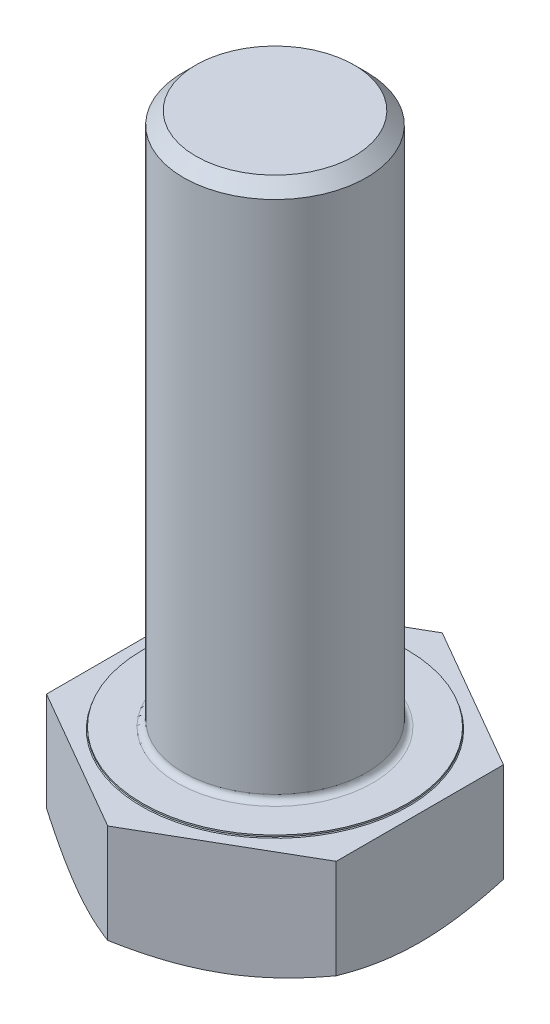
ISO-10303-21;
HEADER;
FILE_DESCRIPTION(('STEP AP214'),'2;1');
FILE_NAME('part.step','',(''),(''),'','','');
FILE_SCHEMA(('AUTOMOTIVE_DESIGN { 1 0 10303 214 1 1 1 1 }'));
ENDSEC;
DATA;
#1=APPLICATION_CONTEXT('core data for automotive mechanical design processes');
#2=APPLICATION_PROTOCOL_DEFINITION('international standard','automotive_design',2000,#1);
#3=PRODUCT_CONTEXT('',#1,'mechanical');
#4=PRODUCT('Part','Part','',(#3));
#5=PRODUCT_RELATED_PRODUCT_CATEGORY('part','',(#4));
#6=PRODUCT_DEFINITION_FORMATION('','',#4);
#7=PRODUCT_DEFINITION_CONTEXT('part definition',#1,'design');
#8=PRODUCT_DEFINITION('design','',#6,#7);
#9=PRODUCT_DEFINITION_SHAPE('','',#8);
#10=(LENGTH_UNIT() NAMED_UNIT(*) SI_UNIT(.MILLI.,.METRE.));
#11=(NAMED_UNIT(*) PLANE_ANGLE_UNIT() SI_UNIT($,.RADIAN.));
#12=(NAMED_UNIT(*) SI_UNIT($,.STERADIAN.) SOLID_ANGLE_UNIT());
#13=UNCERTAINTY_MEASURE_WITH_UNIT(LENGTH_MEASURE(1.E-05),#10,'distance_accuracy_value','');
#14=(GEOMETRIC_REPRESENTATION_CONTEXT(3) GLOBAL_UNCERTAINTY_ASSIGNED_CONTEXT((#13)) GLOBAL_UNIT_ASSIGNED_CONTEXT((#10,
#11,#12)) REPRESENTATION_CONTEXT('',''));
#15=CARTESIAN_POINT('',(0.,0.,0.));
#16=DIRECTION('',(0.,0.,1.));
#17=DIRECTION('',(1.,0.,0.));
#18=AXIS2_PLACEMENT_3D('',#15,#16,#17);
#19=CARTESIAN_POINT('',(0.,-7.5,0.));
#20=DIRECTION('',(0.,-1.,0.));
#21=DIRECTION('',(0.,0.,-1.));
#22=AXIS2_PLACEMENT_3D('',#19,#20,#21);
#23=PLANE('',#22);
#24=CARTESIAN_POINT('',(0.,-7.49999999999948,0.));
#25=DIRECTION('',(0.,1.,0.));
#26=DIRECTION('',(0.,0.,1.));
#27=AXIS2_PLACEMENT_3D('',#24,#25,#26);
#28=CIRCLE('',#27,9.4999999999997);
#29=CARTESIAN_POINT('',(-9.49999999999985,-7.49999999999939,0.));
#30=VERTEX_POINT('',#29);
#31=CARTESIAN_POINT('',(-4.74999999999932,-7.50000000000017,8.22724133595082));
#32=VERTEX_POINT('',#31);
#33=EDGE_CURVE('E174',#30,#32,#28,.T.);
#34=ORIENTED_EDGE('',*,*,#33,.F.);
#35=CARTESIAN_POINT('',(0.,-7.49999999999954,0.));
#36=DIRECTION('',(0.,1.,0.));
#37=DIRECTION('',(0.,0.,1.));
#38=AXIS2_PLACEMENT_3D('',#35,#36,#37);
#39=CIRCLE('',#38,9.49999999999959);
#40=CARTESIAN_POINT('',(-4.74999999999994,-7.49999999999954,-8.2272413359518));
#41=VERTEX_POINT('',#40);
#42=EDGE_CURVE('E59',#41,#30,#39,.T.);
#43=ORIENTED_EDGE('',*,*,#42,.F.);
#44=CARTESIAN_POINT('',(0.,-7.49999999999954,0.));
#45=DIRECTION('',(0.,1.,0.));
#46=DIRECTION('',(0.,0.,1.));
#47=AXIS2_PLACEMENT_3D('',#44,#45,#46);
#48=CIRCLE('',#47,9.49999999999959);
#49=CARTESIAN_POINT('',(4.74999999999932,-7.50000000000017,-8.22724133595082));
#50=VERTEX_POINT('',#49);
#51=EDGE_CURVE('E76',#50,#41,#48,.T.);
#52=ORIENTED_EDGE('',*,*,#51,.F.);
#53=CARTESIAN_POINT('',(0.,-7.49999999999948,0.));
#54=DIRECTION('',(0.,1.,0.));
#55=DIRECTION('',(0.,0.,1.));
#56=AXIS2_PLACEMENT_3D('',#53,#54,#55);
#57=CIRCLE('',#56,9.4999999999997);
#58=CARTESIAN_POINT('',(9.49999999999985,-7.49999999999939,0.));
#59=VERTEX_POINT('',#58);
#60=EDGE_CURVE('E74',#59,#50,#57,.T.);
#61=ORIENTED_EDGE('',*,*,#60,.F.);
#62=CARTESIAN_POINT('',(0.,-7.49999999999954,0.));
#63=DIRECTION('',(0.,1.,0.));
#64=DIRECTION('',(0.,0.,1.));
#65=AXIS2_PLACEMENT_3D('',#62,#63,#64);
#66=CIRCLE('',#65,9.49999999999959);
#67=CARTESIAN_POINT('',(4.74999999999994,-7.49999999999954,8.2272413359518));
#68=VERTEX_POINT('',#67);
#69=EDGE_CURVE('E175',#68,#59,#66,.T.);
#70=ORIENTED_EDGE('',*,*,#69,.F.);
#71=CARTESIAN_POINT('',(0.,-7.49999999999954,0.));
#72=DIRECTION('',(0.,1.,0.));
#73=DIRECTION('',(0.,0.,1.));
#74=AXIS2_PLACEMENT_3D('',#71,#72,#73);
#75=CIRCLE('',#74,9.49999999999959);
#76=EDGE_CURVE('E170',#32,#68,#75,.T.);
#77=ORIENTED_EDGE('',*,*,#76,.F.);
#78=EDGE_LOOP('',(#34,#43,#52,#61,#70,#77));
#79=FACE_BOUND('',#78,.T.);
#80=ADVANCED_FACE('F42',(#79),#23,.T.);
#81=CARTESIAN_POINT('',(0.,-6.64640318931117,0.));
#82=DIRECTION('',(0.,1.,0.));
#83=DIRECTION('',(0.,0.,1.));
#84=AXIS2_PLACEMENT_3D('',#81,#82,#83);
#85=CONICAL_SURFACE('',#84,10.9784730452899,1.0471975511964);
#86=CARTESIAN_POINT('',(9.49999999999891,-6.6514942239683,-5.48482755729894));
#87=CARTESIAN_POINT('',(9.11335202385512,-6.78040921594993,-5.70805887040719));
#88=CARTESIAN_POINT('',(8.72360763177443,-6.89851785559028,-5.93307790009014));
#89=CARTESIAN_POINT('',(7.94068328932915,-7.10680031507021,-6.38509947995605));
#90=CARTESIAN_POINT('',(7.54753064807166,-7.19711226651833,-6.61208626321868));
#91=CARTESIAN_POINT('',(6.95409127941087,-7.30800000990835,-6.95470864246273));
#92=CARTESIAN_POINT('',(6.75552851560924,-7.34087935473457,-7.06934890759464));
#93=CARTESIAN_POINT('',(6.35745238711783,-7.39779418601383,-7.29917826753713));
#94=CARTESIAN_POINT('',(6.15793904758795,-7.42182990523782,-7.41436734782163));
#95=CARTESIAN_POINT('',(5.75722379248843,-7.46063517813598,-7.64572040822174));
#96=CARTESIAN_POINT('',(5.55601842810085,-7.47535760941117,-7.76188637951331));
#97=CARTESIAN_POINT('',(5.15321199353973,-7.49506039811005,-7.9944467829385));
#98=CARTESIAN_POINT('',(4.95161085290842,-7.50003882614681,-8.11084125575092));
#99=CARTESIAN_POINT('',(4.74999999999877,-7.50000000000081,-8.22724133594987));
#100=B_SPLINE_CURVE_WITH_KNOTS('',3,(#86,#87,#88,#89,#90,#91,#92,#93,#94,#95,#96,#97,#98,#99),
.UNSPECIFIED.,.F.,.F.,(4,2,2,2,2,2,4),(0.,1.39466965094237,2.78229242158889,3.47701423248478,
4.17171775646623,4.86990873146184,5.5682379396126),.UNSPECIFIED.);
#101=CARTESIAN_POINT('',(9.5,-6.65149422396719,-5.484827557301));
#102=VERTEX_POINT('',#101);
#103=EDGE_CURVE('E159',#102,#50,#100,.T.);
#104=ORIENTED_EDGE('',*,*,#103,.F.);
#105=CARTESIAN_POINT('',(9.5,-7.4999999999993,0.));
#106=CARTESIAN_POINT('',(9.5,-7.5000388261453,-0.232800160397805));
#107=CARTESIAN_POINT('',(9.5,-7.49506039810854,-0.465589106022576));
#108=CARTESIAN_POINT('',(9.5,-7.47535760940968,-0.930709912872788));
#109=CARTESIAN_POINT('',(9.5,-7.4606351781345,-1.16304185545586));
#110=CARTESIAN_POINT('',(9.5,-7.42182990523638,-1.6257479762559));
#111=CARTESIAN_POINT('',(9.5,-7.3977941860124,-1.85612613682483));
#112=CARTESIAN_POINT('',(9.5,-7.34087935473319,-2.31578485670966));
#113=CARTESIAN_POINT('',(9.5,-7.308000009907,-2.5450653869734));
#114=CARTESIAN_POINT('',(9.5,-7.19711226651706,-3.23031014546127));
#115=CARTESIAN_POINT('',(9.5,-7.10680031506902,-3.68428371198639));
#116=CARTESIAN_POINT('',(9.5,-6.89851785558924,-4.58832687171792));
#117=CARTESIAN_POINT('',(9.5,-6.78040921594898,-5.03836493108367));
#118=CARTESIAN_POINT('',(9.5,-6.65149422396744,-5.48482755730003));
#119=B_SPLINE_CURVE_WITH_KNOTS('',3,(#105,#106,#107,#108,#109,#110,#111,#112,#113,#114,#115,
#116,#117,#118),.UNSPECIFIED.,.F.,.F.,(4,2,2,2,2,2,4),(0.,0.698329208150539,1.39652018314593,
2.09122370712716,2.78594551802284,4.17356828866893,5.56823793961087),.UNSPECIFIED.);
#120=EDGE_CURVE('E309',#59,#102,#119,.T.);
#121=ORIENTED_EDGE('',*,*,#120,.F.);
#122=ORIENTED_EDGE('',*,*,#60,.T.);
#123=EDGE_LOOP('',(#104,#121,#122));
#124=FACE_BOUND('',#123,.T.);
#125=ADVANCED_FACE('F315',(#124),#85,.T.);
#126=CARTESIAN_POINT('',(0.,-6.64640318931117,0.));
#127=DIRECTION('',(0.,1.,0.));
#128=DIRECTION('',(0.,0.,1.));
#129=AXIS2_PLACEMENT_3D('',#126,#127,#128);
#130=CONICAL_SURFACE('',#129,10.9784730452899,1.0471975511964);
#131=CARTESIAN_POINT('',(9.5,-6.65149422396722,5.48482755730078));
#132=CARTESIAN_POINT('',(9.5,-6.7804092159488,5.03836493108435));
#133=CARTESIAN_POINT('',(9.5,-6.89851785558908,4.58832687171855));
#134=CARTESIAN_POINT('',(9.5,-7.10680031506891,3.6842837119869));
#135=CARTESIAN_POINT('',(9.5,-7.19711226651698,3.23031014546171));
#136=CARTESIAN_POINT('',(9.5,-7.30800000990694,2.54506538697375));
#137=CARTESIAN_POINT('',(9.5,-7.34087935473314,2.31578485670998));
#138=CARTESIAN_POINT('',(9.5,-7.39779418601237,1.85612613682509));
#139=CARTESIAN_POINT('',(9.5,-7.42182990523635,1.62574797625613));
#140=CARTESIAN_POINT('',(9.5,-7.46063517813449,1.16304185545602));
#141=CARTESIAN_POINT('',(9.5,-7.47535760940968,0.930709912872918));
#142=CARTESIAN_POINT('',(9.5,-7.49506039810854,0.465589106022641));
#143=CARTESIAN_POINT('',(9.5,-7.5000388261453,0.232800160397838));
#144=CARTESIAN_POINT('',(9.5,-7.4999999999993,0.));
#145=B_SPLINE_CURVE_WITH_KNOTS('',3,(#131,#132,#133,#134,#135,#136,#137,#138,#139,#140,#141,
#142,#143,#144),.UNSPECIFIED.,.F.,.F.,(4,2,2,2,2,2,4),(0.,1.39466965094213,2.78229242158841,
3.47701423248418,4.17171775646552,4.869908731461,5.56823793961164),.UNSPECIFIED.);
#146=CARTESIAN_POINT('',(9.5,-6.65149422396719,5.484827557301));
#147=VERTEX_POINT('',#146);
#148=EDGE_CURVE('E269',#147,#59,#145,.T.);
#149=ORIENTED_EDGE('',*,*,#148,.F.);
#150=CARTESIAN_POINT('',(4.74999999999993,-7.49999999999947,8.22724133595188));
#151=CARTESIAN_POINT('',(4.95161085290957,-7.50003882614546,8.11084125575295));
#152=CARTESIAN_POINT('',(5.15321199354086,-7.49506039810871,7.99444678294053));
#153=CARTESIAN_POINT('',(5.55601842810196,-7.47535760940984,7.76188637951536));
#154=CARTESIAN_POINT('',(5.75722379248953,-7.46063517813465,7.64572040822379));
#155=CARTESIAN_POINT('',(6.15793904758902,-7.42182990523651,7.4143673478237));
#156=CARTESIAN_POINT('',(6.35745238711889,-7.39779418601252,7.29917826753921));
#157=CARTESIAN_POINT('',(6.75552851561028,-7.34087935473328,7.06934890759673));
#158=CARTESIAN_POINT('',(6.95409127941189,-7.30800000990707,6.95470864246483));
#159=CARTESIAN_POINT('',(7.54753064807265,-7.19711226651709,6.6120862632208));
#160=CARTESIAN_POINT('',(7.94068328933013,-7.106800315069,6.38509947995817));
#161=CARTESIAN_POINT('',(8.72360763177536,-6.89851785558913,5.93307790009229));
#162=CARTESIAN_POINT('',(9.11335202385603,-6.78040921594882,5.70805887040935));
#163=CARTESIAN_POINT('',(9.4999999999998,-6.65149422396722,5.48482755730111));
#164=B_SPLINE_CURVE_WITH_KNOTS('',3,(#150,#151,#152,#153,#154,#155,#156,#157,#158,#159,#160,
#161,#162,#163),.UNSPECIFIED.,.F.,.F.,(4,2,2,2,2,2,4),(0.,0.698329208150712,1.39652018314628,
2.09122370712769,2.78594551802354,4.17356828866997,5.56823793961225),.UNSPECIFIED.);
#165=EDGE_CURVE('E244',#68,#147,#164,.T.);
#166=ORIENTED_EDGE('',*,*,#165,.F.);
#167=ORIENTED_EDGE('',*,*,#69,.T.);
#168=EDGE_LOOP('',(#149,#166,#167));
#169=FACE_BOUND('',#168,.T.);
#170=ADVANCED_FACE('F277',(#169),#130,.T.);
#171=CARTESIAN_POINT('',(0.,-6.64640318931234,0.));
#172=DIRECTION('',(0.,1.,0.));
#173=DIRECTION('',(0.,0.,1.));
#174=AXIS2_PLACEMENT_3D('',#171,#172,#173);
#175=CONICAL_SURFACE('',#174,10.9784730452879,1.0471975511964);
#176=CARTESIAN_POINT('',(1.11102152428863E-12,-6.65149422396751,10.969655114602));
#177=CARTESIAN_POINT('',(0.386647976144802,-6.78040921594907,10.7464238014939));
#178=CARTESIAN_POINT('',(0.776392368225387,-6.89851785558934,10.521404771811));
#179=CARTESIAN_POINT('',(1.55931671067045,-7.10680031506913,10.0693831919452));
#180=CARTESIAN_POINT('',(1.95246935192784,-7.19711226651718,9.84239640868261));
#181=CARTESIAN_POINT('',(2.54590872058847,-7.30800000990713,9.49977402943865));
#182=CARTESIAN_POINT('',(2.74447148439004,-7.34087935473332,9.38513376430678));
#183=CARTESIAN_POINT('',(3.14254761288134,-7.39779418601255,9.15530440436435));
#184=CARTESIAN_POINT('',(3.34206095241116,-7.42182990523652,9.04011532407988));
#185=CARTESIAN_POINT('',(3.74277620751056,-7.46063517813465,8.80876226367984));
#186=CARTESIAN_POINT('',(3.94398157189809,-7.47535760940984,8.69259629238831));
#187=CARTESIAN_POINT('',(4.34678800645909,-7.4950603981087,8.46003588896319));
#188=CARTESIAN_POINT('',(4.54838914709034,-7.50003882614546,8.34364141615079));
#189=CARTESIAN_POINT('',(4.74999999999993,-7.49999999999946,8.22724133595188));
#190=B_SPLINE_CURVE_WITH_KNOTS('',3,(#176,#177,#178,#179,#180,#181,#182,#183,#184,#185,#186,
#187,#188,#189),.UNSPECIFIED.,.F.,.F.,(4,2,2,2,2,2,4),(0.,1.39466965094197,2.78229242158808,
3.47701423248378,4.17171775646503,4.86990873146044,5.56823793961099),.UNSPECIFIED.);
#191=CARTESIAN_POINT('',(1.27805752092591E-12,-6.65149422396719,10.9696551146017));
#192=VERTEX_POINT('',#191);
#193=EDGE_CURVE('E287',#192,#68,#190,.T.);
#194=ORIENTED_EDGE('',*,*,#193,.F.);
#195=CARTESIAN_POINT('',(-4.74999999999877,-7.50000000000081,8.22724133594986));
#196=CARTESIAN_POINT('',(-4.54838914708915,-7.50003882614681,8.34364141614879));
#197=CARTESIAN_POINT('',(-4.34678800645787,-7.49506039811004,8.4600358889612));
#198=CARTESIAN_POINT('',(-3.94398157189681,-7.47535760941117,8.69259629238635));
#199=CARTESIAN_POINT('',(-3.74277620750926,-7.46063517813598,8.80876226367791));
#200=CARTESIAN_POINT('',(-3.34206095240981,-7.42182990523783,9.04011532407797));
#201=CARTESIAN_POINT('',(-3.14254761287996,-7.39779418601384,9.15530440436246));
#202=CARTESIAN_POINT('',(-2.74447148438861,-7.34087935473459,9.38513376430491));
#203=CARTESIAN_POINT('',(-2.54590872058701,-7.30800000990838,9.4997740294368));
#204=CARTESIAN_POINT('',(-1.95246935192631,-7.19711226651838,9.8423964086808));
#205=CARTESIAN_POINT('',(-1.55931671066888,-7.10680031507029,10.0693831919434));
#206=CARTESIAN_POINT('',(-0.776392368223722,-6.8985178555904,10.5214047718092));
#207=CARTESIAN_POINT('',(-0.386647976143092,-6.78040921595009,10.7464238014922));
#208=CARTESIAN_POINT('',(6.43493569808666E-13,-6.65149422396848,10.9696551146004));
#209=B_SPLINE_CURVE_WITH_KNOTS('',3,(#195,#196,#197,#198,#199,#200,#201,#202,#203,#204,#205,
#206,#207,#208),.UNSPECIFIED.,.F.,.F.,(4,2,2,2,2,2,4),(0.,0.69832920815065,1.39652018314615,
2.09122370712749,2.78594551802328,4.17356828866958,5.56823793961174),.UNSPECIFIED.);
#210=EDGE_CURVE('E243',#32,#192,#209,.T.);
#211=ORIENTED_EDGE('',*,*,#210,.F.);
#212=ORIENTED_EDGE('',*,*,#76,.T.);
#213=EDGE_LOOP('',(#194,#211,#212));
#214=FACE_BOUND('',#213,.T.);
#215=ADVANCED_FACE('F273',(#214),#175,.T.);
#216=CARTESIAN_POINT('',(0.,-6.64640318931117,0.));
#217=DIRECTION('',(0.,1.,0.));
#218=DIRECTION('',(0.,0.,1.));
#219=AXIS2_PLACEMENT_3D('',#216,#217,#218);
#220=CONICAL_SURFACE('',#219,10.9784730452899,1.0471975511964);
#221=CARTESIAN_POINT('',(-9.49999999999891,-6.6514942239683,5.48482755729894));
#222=CARTESIAN_POINT('',(-9.11335202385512,-6.78040921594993,5.70805887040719));
#223=CARTESIAN_POINT('',(-8.72360763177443,-6.89851785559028,5.93307790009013));
#224=CARTESIAN_POINT('',(-7.94068328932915,-7.10680031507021,6.38509947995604));
#225=CARTESIAN_POINT('',(-7.54753064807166,-7.19711226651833,6.61208626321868));
#226=CARTESIAN_POINT('',(-6.95409127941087,-7.30800000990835,6.95470864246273));
#227=CARTESIAN_POINT('',(-6.75552851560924,-7.34087935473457,7.06934890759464));
#228=CARTESIAN_POINT('',(-6.35745238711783,-7.39779418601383,7.29917826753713));
#229=CARTESIAN_POINT('',(-6.15793904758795,-7.42182990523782,7.41436734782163));
#230=CARTESIAN_POINT('',(-5.75722379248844,-7.46063517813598,7.64572040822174));
#231=CARTESIAN_POINT('',(-5.55601842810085,-7.47535760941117,7.76188637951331));
#232=CARTESIAN_POINT('',(-5.15321199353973,-7.49506039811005,7.9944467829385));
#233=CARTESIAN_POINT('',(-4.95161085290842,-7.50003882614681,8.11084125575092));
#234=CARTESIAN_POINT('',(-4.74999999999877,-7.50000000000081,8.22724133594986));
#235=B_SPLINE_CURVE_WITH_KNOTS('',3,(#221,#222,#223,#224,#225,#226,#227,#228,#229,#230,#231,
#232,#233,#234),.UNSPECIFIED.,.F.,.F.,(4,2,2,2,2,2,4),(0.,1.39466965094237,2.78229242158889,
3.47701423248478,4.17171775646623,4.86990873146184,5.5682379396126),.UNSPECIFIED.);
#236=CARTESIAN_POINT('',(-9.49999999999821,-6.65149422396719,5.48482755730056));
#237=VERTEX_POINT('',#236);
#238=EDGE_CURVE('E239',#237,#32,#235,.T.);
#239=ORIENTED_EDGE('',*,*,#238,.F.);
#240=CARTESIAN_POINT('',(-9.5,-7.4999999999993,0.));
#241=CARTESIAN_POINT('',(-9.5,-7.5000388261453,0.232800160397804));
#242=CARTESIAN_POINT('',(-9.5,-7.49506039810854,0.465589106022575));
#243=CARTESIAN_POINT('',(-9.5,-7.47535760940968,0.930709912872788));
#244=CARTESIAN_POINT('',(-9.5,-7.4606351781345,1.16304185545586));
#245=CARTESIAN_POINT('',(-9.5,-7.42182990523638,1.6257479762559));
#246=CARTESIAN_POINT('',(-9.5,-7.3977941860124,1.85612613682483));
#247=CARTESIAN_POINT('',(-9.5,-7.34087935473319,2.31578485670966));
#248=CARTESIAN_POINT('',(-9.5,-7.308000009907,2.5450653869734));
#249=CARTESIAN_POINT('',(-9.5,-7.19711226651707,3.23031014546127));
#250=CARTESIAN_POINT('',(-9.5,-7.10680031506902,3.68428371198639));
#251=CARTESIAN_POINT('',(-9.5,-6.89851785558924,4.58832687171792));
#252=CARTESIAN_POINT('',(-9.5,-6.78040921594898,5.03836493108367));
#253=CARTESIAN_POINT('',(-9.5,-6.65149422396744,5.48482755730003));
#254=B_SPLINE_CURVE_WITH_KNOTS('',3,(#240,#241,#242,#243,#244,#245,#246,#247,#248,#249,#250,
#251,#252,#253),.UNSPECIFIED.,.F.,.F.,(4,2,2,2,2,2,4),(0.,0.698329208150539,1.39652018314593,
2.09122370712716,2.78594551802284,4.17356828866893,5.56823793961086),.UNSPECIFIED.);
#255=EDGE_CURVE('E250',#30,#237,#254,.T.);
#256=ORIENTED_EDGE('',*,*,#255,.F.);
#257=ORIENTED_EDGE('',*,*,#33,.T.);
#258=EDGE_LOOP('',(#239,#256,#257));
#259=FACE_BOUND('',#258,.T.);
#260=ADVANCED_FACE('F207',(#259),#220,.T.);
#261=CARTESIAN_POINT('',(0.,-6.64640318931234,0.));
#262=DIRECTION('',(0.,1.,0.));
#263=DIRECTION('',(0.,0.,1.));
#264=AXIS2_PLACEMENT_3D('',#261,#262,#263);
#265=CONICAL_SURFACE('',#264,10.9784730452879,1.0471975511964);
#266=CARTESIAN_POINT('',(-1.27288073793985E-12,-6.65149422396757,-10.969655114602));
#267=CARTESIAN_POINT('',(-0.386647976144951,-6.78040921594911,-10.7464238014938));
#268=CARTESIAN_POINT('',(-0.776392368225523,-6.89851785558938,-10.5214047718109));
#269=CARTESIAN_POINT('',(-1.55931671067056,-7.10680031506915,-10.0693831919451));
#270=CARTESIAN_POINT('',(-1.95246935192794,-7.1971122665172,-9.84239640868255));
#271=CARTESIAN_POINT('',(-2.54590872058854,-7.30800000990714,-9.49977402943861));
#272=CARTESIAN_POINT('',(-2.74447148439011,-7.34087935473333,-9.38513376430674));
#273=CARTESIAN_POINT('',(-3.14254761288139,-7.39779418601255,-9.15530440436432));
#274=CARTESIAN_POINT('',(-3.34206095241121,-7.42182990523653,-9.04011532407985));
#275=CARTESIAN_POINT('',(-3.7427762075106,-7.46063517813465,-8.80876226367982));
#276=CARTESIAN_POINT('',(-3.94398157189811,-7.47535760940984,-8.69259629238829));
#277=CARTESIAN_POINT('',(-4.3467880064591,-7.4950603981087,-8.46003588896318));
#278=CARTESIAN_POINT('',(-4.54838914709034,-7.50003882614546,-8.34364141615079));
#279=CARTESIAN_POINT('',(-4.74999999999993,-7.49999999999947,-8.22724133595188));
#280=B_SPLINE_CURVE_WITH_KNOTS('',3,(#266,#267,#268,#269,#270,#271,#272,#273,#274,#275,#276,
#277,#278,#279),.UNSPECIFIED.,.F.,.F.,(4,2,2,2,2,2,4),(0.,1.39466965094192,2.78229242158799,
3.47701423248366,4.17171775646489,4.86990873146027,5.5682379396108),.UNSPECIFIED.);
#281=CARTESIAN_POINT('',(1.05904868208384E-12,-6.65149422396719,-10.9696551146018));
#282=VERTEX_POINT('',#281);
#283=EDGE_CURVE('E196',#282,#41,#280,.T.);
#284=ORIENTED_EDGE('',*,*,#283,.F.);
#285=CARTESIAN_POINT('',(4.74999999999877,-7.50000000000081,-8.22724133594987));
#286=CARTESIAN_POINT('',(4.54838914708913,-7.50003882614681,-8.34364141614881));
#287=CARTESIAN_POINT('',(4.34678800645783,-7.49506039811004,-8.46003588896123));
#288=CARTESIAN_POINT('',(3.94398157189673,-7.47535760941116,-8.6925962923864));
#289=CARTESIAN_POINT('',(3.74277620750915,-7.46063517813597,-8.80876226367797));
#290=CARTESIAN_POINT('',(3.34206095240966,-7.42182990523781,-9.04011532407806));
#291=CARTESIAN_POINT('',(3.14254761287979,-7.39779418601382,-9.15530440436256));
#292=CARTESIAN_POINT('',(2.7444714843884,-7.34087935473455,-9.38513376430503));
#293=CARTESIAN_POINT('',(2.54590872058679,-7.30800000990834,-9.49977402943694));
#294=CARTESIAN_POINT('',(1.95246935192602,-7.19711226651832,-9.84239640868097));
#295=CARTESIAN_POINT('',(1.55931671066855,-7.10680031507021,-10.0693831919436));
#296=CARTESIAN_POINT('',(0.776392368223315,-6.89851785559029,-10.5214047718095));
#297=CARTESIAN_POINT('',(0.386647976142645,-6.78040921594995,-10.7464238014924));
#298=CARTESIAN_POINT('',(-1.12690990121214E-12,-6.65149422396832,-10.9696551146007));
#299=B_SPLINE_CURVE_WITH_KNOTS('',3,(#285,#286,#287,#288,#289,#290,#291,#292,#293,#294,#295,
#296,#297,#298),.UNSPECIFIED.,.F.,.F.,(4,2,2,2,2,2,4),(0.,0.698329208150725,1.3965201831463,
2.09122370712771,2.78594551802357,4.17356828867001,5.56823793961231),.UNSPECIFIED.);
#300=EDGE_CURVE('E144',#50,#282,#299,.T.);
#301=ORIENTED_EDGE('',*,*,#300,.F.);
#302=ORIENTED_EDGE('',*,*,#51,.T.);
#303=EDGE_LOOP('',(#284,#301,#302));
#304=FACE_BOUND('',#303,.T.);
#305=ADVANCED_FACE('F202',(#304),#265,.T.);
#306=CARTESIAN_POINT('',(0.,-6.64640318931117,0.));
#307=DIRECTION('',(0.,1.,0.));
#308=DIRECTION('',(0.,0.,1.));
#309=AXIS2_PLACEMENT_3D('',#306,#307,#308);
#310=CONICAL_SURFACE('',#309,10.9784730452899,1.0471975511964);
#311=CARTESIAN_POINT('',(-9.5,-6.65149422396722,-5.48482755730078));
#312=CARTESIAN_POINT('',(-9.5,-6.7804092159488,-5.03836493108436));
#313=CARTESIAN_POINT('',(-9.5,-6.89851785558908,-4.58832687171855));
#314=CARTESIAN_POINT('',(-9.5,-7.10680031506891,-3.6842837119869));
#315=CARTESIAN_POINT('',(-9.5,-7.19711226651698,-3.23031014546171));
#316=CARTESIAN_POINT('',(-9.5,-7.30800000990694,-2.54506538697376));
#317=CARTESIAN_POINT('',(-9.5,-7.34087935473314,-2.31578485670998));
#318=CARTESIAN_POINT('',(-9.5,-7.39779418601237,-1.85612613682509));
#319=CARTESIAN_POINT('',(-9.5,-7.42182990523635,-1.62574797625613));
#320=CARTESIAN_POINT('',(-9.5,-7.46063517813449,-1.16304185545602));
#321=CARTESIAN_POINT('',(-9.5,-7.47535760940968,-0.930709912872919));
#322=CARTESIAN_POINT('',(-9.5,-7.49506039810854,-0.465589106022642));
#323=CARTESIAN_POINT('',(-9.5,-7.5000388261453,-0.232800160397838));
#324=CARTESIAN_POINT('',(-9.5,-7.4999999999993,0.));
#325=B_SPLINE_CURVE_WITH_KNOTS('',3,(#311,#312,#313,#314,#315,#316,#317,#318,#319,#320,#321,
#322,#323,#324),.UNSPECIFIED.,.F.,.F.,(4,2,2,2,2,2,4),(0.,1.39466965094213,2.78229242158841,
3.47701423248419,4.17171775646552,4.86990873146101,5.56823793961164),.UNSPECIFIED.);
#326=CARTESIAN_POINT('',(-9.5,-6.65149422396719,-5.484827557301));
#327=VERTEX_POINT('',#326);
#328=EDGE_CURVE('E219',#327,#30,#325,.T.);
#329=ORIENTED_EDGE('',*,*,#328,.F.);
#330=CARTESIAN_POINT('',(-4.74999999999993,-7.49999999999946,-8.22724133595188));
#331=CARTESIAN_POINT('',(-4.95161085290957,-7.50003882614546,-8.11084125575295));
#332=CARTESIAN_POINT('',(-5.15321199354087,-7.49506039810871,-7.99444678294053));
#333=CARTESIAN_POINT('',(-5.55601842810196,-7.47535760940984,-7.76188637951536));
#334=CARTESIAN_POINT('',(-5.75722379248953,-7.46063517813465,-7.64572040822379));
#335=CARTESIAN_POINT('',(-6.15793904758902,-7.42182990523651,-7.4143673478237));
#336=CARTESIAN_POINT('',(-6.35745238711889,-7.39779418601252,-7.29917826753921));
#337=CARTESIAN_POINT('',(-6.75552851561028,-7.34087935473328,-7.06934890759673));
#338=CARTESIAN_POINT('',(-6.95409127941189,-7.30800000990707,-6.95470864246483));
#339=CARTESIAN_POINT('',(-7.54753064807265,-7.19711226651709,-6.6120862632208));
#340=CARTESIAN_POINT('',(-7.94068328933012,-7.106800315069,-6.38509947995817));
#341=CARTESIAN_POINT('',(-8.72360763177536,-6.89851785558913,-5.93307790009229));
#342=CARTESIAN_POINT('',(-9.11335202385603,-6.78040921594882,-5.70805887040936));
#343=CARTESIAN_POINT('',(-9.4999999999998,-6.65149422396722,-5.48482755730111));
#344=B_SPLINE_CURVE_WITH_KNOTS('',3,(#330,#331,#332,#333,#334,#335,#336,#337,#338,#339,#340,
#341,#342,#343),.UNSPECIFIED.,.F.,.F.,(4,2,2,2,2,2,4),(0.,0.698329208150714,1.39652018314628,
2.09122370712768,2.78594551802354,4.17356828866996,5.56823793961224),.UNSPECIFIED.);
#345=EDGE_CURVE('E238',#41,#327,#344,.T.);
#346=ORIENTED_EDGE('',*,*,#345,.F.);
#347=ORIENTED_EDGE('',*,*,#42,.T.);
#348=EDGE_LOOP('',(#329,#346,#347));
#349=FACE_BOUND('',#348,.T.);
#350=ADVANCED_FACE('F206',(#349),#310,.T.);
#351=CARTESIAN_POINT('',(0.,0.,-10.9696551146));
#352=DIRECTION('',(0.500000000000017,0.,-0.866025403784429));
#353=DIRECTION('',(-0.866025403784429,0.,-0.500000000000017));
#354=AXIS2_PLACEMENT_3D('',#351,#352,#353);
#355=PLANE('',#354);
#356=ORIENTED_EDGE('',*,*,#300,.T.);
#357=DIRECTION('',(0.,-1.,0.));
#358=VECTOR('',#357,1.);
#359=CARTESIAN_POINT('',(1.05904868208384E-12,-0.15,-10.9696551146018));
#360=LINE('',#359,#358);
#361=CARTESIAN_POINT('',(1.05904868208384E-12,-0.15,-10.9696551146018));
#362=VERTEX_POINT('',#361);
#363=EDGE_CURVE('E140',#362,#282,#360,.T.);
#364=ORIENTED_EDGE('',*,*,#363,.F.);
#365=DIRECTION('',(-0.866025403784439,0.,-0.5));
#366=VECTOR('',#365,1.);
#367=CARTESIAN_POINT('',(1.05904868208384E-12,-0.15,-10.9696551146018));
#368=LINE('',#367,#366);
#369=CARTESIAN_POINT('',(9.5,-0.15,-5.484827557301));
#370=VERTEX_POINT('',#369);
#371=EDGE_CURVE('E129',#370,#362,#368,.T.);
#372=ORIENTED_EDGE('',*,*,#371,.F.);
#373=DIRECTION('',(0.,-1.,0.));
#374=VECTOR('',#373,1.);
#375=CARTESIAN_POINT('',(9.5,-0.15,-5.484827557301));
#376=LINE('',#375,#374);
#377=EDGE_CURVE('E148',#370,#102,#376,.T.);
#378=ORIENTED_EDGE('',*,*,#377,.T.);
#379=ORIENTED_EDGE('',*,*,#103,.T.);
#380=EDGE_LOOP('',(#356,#364,#372,#378,#379));
#381=FACE_BOUND('',#380,.T.);
#382=ADVANCED_FACE('F141',(#381),#355,.T.);
#383=CARTESIAN_POINT('',(9.5,0.,-5.484827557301));
#384=DIRECTION('',(1.,0.,0.));
#385=DIRECTION('',(0.,0.,-1.));
#386=AXIS2_PLACEMENT_3D('',#383,#384,#385);
#387=PLANE('',#386);
#388=ORIENTED_EDGE('',*,*,#120,.T.);
#389=ORIENTED_EDGE('',*,*,#377,.F.);
#390=DIRECTION('',(0.,0.,-1.));
#391=VECTOR('',#390,1.);
#392=CARTESIAN_POINT('',(9.5,-0.15,-5.484827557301));
#393=LINE('',#392,#391);
#394=CARTESIAN_POINT('',(9.5,-0.15,5.484827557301));
#395=VERTEX_POINT('',#394);
#396=EDGE_CURVE('E135',#395,#370,#393,.T.);
#397=ORIENTED_EDGE('',*,*,#396,.F.);
#398=DIRECTION('',(0.,-1.,0.));
#399=VECTOR('',#398,1.);
#400=CARTESIAN_POINT('',(9.5,-0.15,5.484827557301));
#401=LINE('',#400,#399);
#402=EDGE_CURVE('E697',#395,#147,#401,.T.);
#403=ORIENTED_EDGE('',*,*,#402,.T.);
#404=ORIENTED_EDGE('',*,*,#148,.T.);
#405=EDGE_LOOP('',(#388,#389,#397,#403,#404));
#406=FACE_BOUND('',#405,.T.);
#407=ADVANCED_FACE('F313',(#406),#387,.T.);
#408=CARTESIAN_POINT('',(9.5,0.,5.484827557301));
#409=DIRECTION('',(0.500000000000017,0.,0.866025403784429));
#410=DIRECTION('',(0.866025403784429,0.,-0.500000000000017));
#411=AXIS2_PLACEMENT_3D('',#408,#409,#410);
#412=PLANE('',#411);
#413=ORIENTED_EDGE('',*,*,#165,.T.);
#414=ORIENTED_EDGE('',*,*,#402,.F.);
#415=DIRECTION('',(0.866025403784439,0.,-0.5));
#416=VECTOR('',#415,1.);
#417=CARTESIAN_POINT('',(9.5,-0.15,5.484827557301));
#418=LINE('',#417,#416);
#419=CARTESIAN_POINT('',(1.27805752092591E-12,-0.15,10.9696551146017));
#420=VERTEX_POINT('',#419);
#421=EDGE_CURVE('E122',#420,#395,#418,.T.);
#422=ORIENTED_EDGE('',*,*,#421,.F.);
#423=DIRECTION('',(0.,-1.,0.));
#424=VECTOR('',#423,1.);
#425=CARTESIAN_POINT('',(1.27805752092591E-12,-0.15,10.9696551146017));
#426=LINE('',#425,#424);
#427=EDGE_CURVE('E183',#420,#192,#426,.T.);
#428=ORIENTED_EDGE('',*,*,#427,.T.);
#429=ORIENTED_EDGE('',*,*,#193,.T.);
#430=EDGE_LOOP('',(#413,#414,#422,#428,#429));
#431=FACE_BOUND('',#430,.T.);
#432=ADVANCED_FACE('F258',(#431),#412,.T.);
#433=CARTESIAN_POINT('',(0.,0.,10.9696551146));
#434=DIRECTION('',(-0.500000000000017,0.,0.866025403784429));
#435=DIRECTION('',(0.866025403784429,0.,0.500000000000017));
#436=AXIS2_PLACEMENT_3D('',#433,#434,#435);
#437=PLANE('',#436);
#438=ORIENTED_EDGE('',*,*,#210,.T.);
#439=ORIENTED_EDGE('',*,*,#427,.F.);
#440=DIRECTION('',(0.866025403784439,0.,0.5));
#441=VECTOR('',#440,1.);
#442=CARTESIAN_POINT('',(1.27805752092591E-12,-0.15,10.9696551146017));
#443=LINE('',#442,#441);
#444=CARTESIAN_POINT('',(-9.49999999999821,-0.15,5.48482755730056));
#445=VERTEX_POINT('',#444);
#446=EDGE_CURVE('E711',#445,#420,#443,.T.);
#447=ORIENTED_EDGE('',*,*,#446,.F.);
#448=DIRECTION('',(0.,-1.,0.));
#449=VECTOR('',#448,1.);
#450=CARTESIAN_POINT('',(-9.49999999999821,-0.15,5.48482755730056));
#451=LINE('',#450,#449);
#452=EDGE_CURVE('E114',#445,#237,#451,.T.);
#453=ORIENTED_EDGE('',*,*,#452,.T.);
#454=ORIENTED_EDGE('',*,*,#238,.T.);
#455=EDGE_LOOP('',(#438,#439,#447,#453,#454));
#456=FACE_BOUND('',#455,.T.);
#457=ADVANCED_FACE('F254',(#456),#437,.T.);
#458=CARTESIAN_POINT('',(-9.5,0.,5.484827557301));
#459=DIRECTION('',(-1.,0.,0.));
#460=DIRECTION('',(0.,0.,1.));
#461=AXIS2_PLACEMENT_3D('',#458,#459,#460);
#462=PLANE('',#461);
#463=ORIENTED_EDGE('',*,*,#255,.T.);
#464=ORIENTED_EDGE('',*,*,#452,.F.);
#465=DIRECTION('',(0.,0.,1.));
#466=VECTOR('',#465,1.);
#467=CARTESIAN_POINT('',(-9.49999999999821,-0.15,5.48482755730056));
#468=LINE('',#467,#466);
#469=CARTESIAN_POINT('',(-9.49999999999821,-0.15,-5.48482755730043));
#470=VERTEX_POINT('',#469);
#471=EDGE_CURVE('E91',#470,#445,#468,.T.);
#472=ORIENTED_EDGE('',*,*,#471,.F.);
#473=DIRECTION('',(0.,-1.,0.));
#474=VECTOR('',#473,1.);
#475=CARTESIAN_POINT('',(-9.49999999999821,-0.15,-5.48482755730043));
#476=LINE('',#475,#474);
#477=EDGE_CURVE('E83',#470,#327,#476,.T.);
#478=ORIENTED_EDGE('',*,*,#477,.T.);
#479=ORIENTED_EDGE('',*,*,#328,.T.);
#480=EDGE_LOOP('',(#463,#464,#472,#478,#479));
#481=FACE_BOUND('',#480,.T.);
#482=ADVANCED_FACE('F227',(#481),#462,.T.);
#483=CARTESIAN_POINT('',(-9.5,0.,-5.484827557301));
#484=DIRECTION('',(-0.500000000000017,0.,-0.866025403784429));
#485=DIRECTION('',(-0.866025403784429,0.,0.500000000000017));
#486=AXIS2_PLACEMENT_3D('',#483,#484,#485);
#487=PLANE('',#486);
#488=ORIENTED_EDGE('',*,*,#345,.T.);
#489=ORIENTED_EDGE('',*,*,#477,.F.);
#490=DIRECTION('',(-0.866025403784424,0.,0.500000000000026));
#491=VECTOR('',#490,1.);
#492=CARTESIAN_POINT('',(-9.49999999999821,-0.15,-5.48482755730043));
#493=LINE('',#492,#491);
#494=EDGE_CURVE('E133',#362,#470,#493,.T.);
#495=ORIENTED_EDGE('',*,*,#494,.F.);
#496=ORIENTED_EDGE('',*,*,#363,.T.);
#497=ORIENTED_EDGE('',*,*,#283,.T.);
#498=EDGE_LOOP('',(#488,#489,#495,#496,#497));
#499=FACE_BOUND('',#498,.T.);
#500=ADVANCED_FACE('F151',(#499),#487,.T.);
#501=CARTESIAN_POINT('',(0.,-0.15,0.));
#502=DIRECTION('',(0.,-1.,0.));
#503=DIRECTION('',(0.,0.,-1.));
#504=AXIS2_PLACEMENT_3D('',#501,#502,#503);
#505=PLANE('',#504);
#506=CARTESIAN_POINT('',(0.,-0.15,0.));
#507=DIRECTION('',(0.,-1.,0.));
#508=DIRECTION('',(0.,0.,-1.));
#509=AXIS2_PLACEMENT_3D('',#506,#507,#508);
#510=CIRCLE('',#509,8.75);
#511=CARTESIAN_POINT('',(0.,-0.15,-8.75));
#512=VERTEX_POINT('',#511);
#513=EDGE_CURVE('E481',#512,#512,#510,.T.);
#514=ORIENTED_EDGE('',*,*,#513,.T.);
#515=EDGE_LOOP('',(#514));
#516=FACE_BOUND('',#515,.T.);
#517=ORIENTED_EDGE('',*,*,#446,.T.);
#518=ORIENTED_EDGE('',*,*,#421,.T.);
#519=ORIENTED_EDGE('',*,*,#396,.T.);
#520=ORIENTED_EDGE('',*,*,#371,.T.);
#521=ORIENTED_EDGE('',*,*,#494,.T.);
#522=ORIENTED_EDGE('',*,*,#471,.T.);
#523=EDGE_LOOP('',(#517,#518,#519,#520,#521,#522));
#524=FACE_BOUND('',#523,.T.);
#525=ADVANCED_FACE('F131',(#516,#524),#505,.F.);
#526=CARTESIAN_POINT('',(0.,35.,0.));
#527=DIRECTION('',(0.,-1.,0.));
#528=DIRECTION('',(0.,0.,-1.));
#529=AXIS2_PLACEMENT_3D('',#526,#527,#528);
#530=CYLINDRICAL_SURFACE('',#529,6.);
#531=CARTESIAN_POINT('',(0.,0.399999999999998,0.));
#532=DIRECTION('',(0.,1.,0.));
#533=DIRECTION('',(0.,0.,1.));
#534=AXIS2_PLACEMENT_3D('',#531,#532,#533);
#535=CIRCLE('',#534,6.);
#536=CARTESIAN_POINT('',(0.,0.399999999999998,6.));
#537=VERTEX_POINT('',#536);
#538=EDGE_CURVE('E13',#537,#537,#535,.T.);
#539=ORIENTED_EDGE('',*,*,#538,.T.);
#540=EDGE_LOOP('',(#539));
#541=FACE_BOUND('',#540,.T.);
#542=CARTESIAN_POINT('',(0.,34.1881249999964,0.));
#543=DIRECTION('',(0.,1.,0.));
#544=DIRECTION('',(0.,0.,1.));
#545=AXIS2_PLACEMENT_3D('',#542,#543,#544);
#546=CIRCLE('',#545,6.);
#547=CARTESIAN_POINT('',(0.,34.1881249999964,6.));
#548=VERTEX_POINT('',#547);
#549=EDGE_CURVE('E471',#548,#548,#546,.F.);
#550=ORIENTED_EDGE('',*,*,#549,.T.);
#551=EDGE_LOOP('',(#550));
#552=FACE_BOUND('',#551,.T.);
#553=ADVANCED_FACE('F506',(#541,#552),#530,.T.);
#554=CARTESIAN_POINT('',(6.,35.,0.));
#555=DIRECTION('',(0.,1.,0.));
#556=DIRECTION('',(0.,0.,1.));
#557=AXIS2_PLACEMENT_3D('',#554,#555,#556);
#558=PLANE('',#557);
#559=CARTESIAN_POINT('',(0.,35.,0.));
#560=DIRECTION('',(0.,1.,0.));
#561=DIRECTION('',(0.,0.,1.));
#562=AXIS2_PLACEMENT_3D('',#559,#560,#561);
#563=CIRCLE('',#562,5.18812500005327);
#564=CARTESIAN_POINT('',(0.,35.,5.18812500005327));
#565=VERTEX_POINT('',#564);
#566=EDGE_CURVE('E476',#565,#565,#563,.T.);
#567=ORIENTED_EDGE('',*,*,#566,.T.);
#568=EDGE_LOOP('',(#567));
#569=FACE_BOUND('',#568,.T.);
#570=ADVANCED_FACE('F508',(#569),#558,.T.);
#571=CARTESIAN_POINT('',(0.,35.,0.));
#572=DIRECTION('',(0.,-1.,0.));
#573=DIRECTION('',(0.,0.,-1.));
#574=AXIS2_PLACEMENT_3D('',#571,#572,#573);
#575=CYLINDRICAL_SURFACE('',#574,8.7);
#576=CARTESIAN_POINT('',(0.,-0.099999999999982,0.));
#577=DIRECTION('',(0.,-1.,0.));
#578=DIRECTION('',(0.,0.,-1.));
#579=AXIS2_PLACEMENT_3D('',#576,#577,#578);
#580=CIRCLE('',#579,8.7);
#581=CARTESIAN_POINT('',(0.,-0.099999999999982,-8.7));
#582=VERTEX_POINT('',#581);
#583=EDGE_CURVE('E488',#582,#582,#580,.F.);
#584=ORIENTED_EDGE('',*,*,#583,.T.);
#585=EDGE_LOOP('',(#584));
#586=FACE_BOUND('',#585,.T.);
#587=CARTESIAN_POINT('',(0.,0.,0.));
#588=DIRECTION('',(0.,-1.,0.));
#589=DIRECTION('',(0.,0.,-1.));
#590=AXIS2_PLACEMENT_3D('',#587,#588,#589);
#591=CIRCLE('',#590,8.7);
#592=CARTESIAN_POINT('',(0.,0.,-8.7));
#593=VERTEX_POINT('',#592);
#594=EDGE_CURVE('E712',#593,#593,#591,.T.);
#595=ORIENTED_EDGE('',*,*,#594,.T.);
#596=EDGE_LOOP('',(#595));
#597=FACE_BOUND('',#596,.T.);
#598=ADVANCED_FACE('F513',(#586,#597),#575,.T.);
#599=CARTESIAN_POINT('',(8.7,0.,0.));
#600=DIRECTION('',(0.,1.,0.));
#601=DIRECTION('',(0.,0.,1.));
#602=AXIS2_PLACEMENT_3D('',#599,#600,#601);
#603=PLANE('',#602);
#604=CARTESIAN_POINT('',(0.,0.,0.));
#605=DIRECTION('',(0.,1.,0.));
#606=DIRECTION('',(0.,0.,1.));
#607=AXIS2_PLACEMENT_3D('',#604,#605,#606);
#608=CIRCLE('',#607,6.4);
#609=CARTESIAN_POINT('',(0.,0.,6.4));
#610=VERTEX_POINT('',#609);
#611=EDGE_CURVE('E51',#610,#610,#608,.F.);
#612=ORIENTED_EDGE('',*,*,#611,.T.);
#613=EDGE_LOOP('',(#612));
#614=FACE_BOUND('',#613,.T.);
#615=ORIENTED_EDGE('',*,*,#594,.F.);
#616=EDGE_LOOP('',(#615));
#617=FACE_BOUND('',#616,.T.);
#618=ADVANCED_FACE('F493',(#614,#617),#603,.T.);
#619=CARTESIAN_POINT('',(0.,34.1881249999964,0.));
#620=DIRECTION('',(0.,-1.,0.));
#621=DIRECTION('',(0.,0.,-1.));
#622=AXIS2_PLACEMENT_3D('',#619,#620,#621);
#623=CONICAL_SURFACE('',#622,6.,0.785398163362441);
#624=ORIENTED_EDGE('',*,*,#566,.F.);
#625=EDGE_LOOP('',(#624));
#626=FACE_BOUND('',#625,.T.);
#627=ORIENTED_EDGE('',*,*,#549,.F.);
#628=EDGE_LOOP('',(#627));
#629=FACE_BOUND('',#628,.T.);
#630=ADVANCED_FACE('F502',(#626,#629),#623,.T.);
#631=CARTESIAN_POINT('',(0.,-0.149999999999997,0.));
#632=DIRECTION('',(0.,-1.,0.));
#633=DIRECTION('',(0.,0.,-1.));
#634=AXIS2_PLACEMENT_3D('',#631,#632,#633);
#635=CONICAL_SURFACE('',#634,8.74999999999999,0.78539816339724);
#636=ORIENTED_EDGE('',*,*,#583,.F.);
#637=EDGE_LOOP('',(#636));
#638=FACE_BOUND('',#637,.T.);
#639=ORIENTED_EDGE('',*,*,#513,.F.);
#640=EDGE_LOOP('',(#639));
#641=FACE_BOUND('',#640,.T.);
#642=ADVANCED_FACE('F497',(#638,#641),#635,.T.);
#643=CARTESIAN_POINT('',(0.,0.399999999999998,0.));
#644=DIRECTION('',(0.,1.,0.));
#645=DIRECTION('',(0.,0.,1.));
#646=AXIS2_PLACEMENT_3D('',#643,#644,#645);
#647=TOROIDAL_SURFACE('',#646,6.4,0.4);
#648=ORIENTED_EDGE('',*,*,#538,.F.);
#649=EDGE_LOOP('',(#648));
#650=FACE_BOUND('',#649,.T.);
#651=ORIENTED_EDGE('',*,*,#611,.F.);
#652=EDGE_LOOP('',(#651));
#653=FACE_BOUND('',#652,.T.);
#654=ADVANCED_FACE('F44',(#650,#653),#647,.F.);
#655=CLOSED_SHELL('',(#80,#125,#170,#215,#260,#305,#350,#382,#407,#432,#457,#482,#500,#525,#553,
#570,#598,#618,#630,#642,#654));
#656=MANIFOLD_SOLID_BREP('B2',#655);
#657=ADVANCED_BREP_SHAPE_REPRESENTATION('',(#18,#656),#14);
#658=SHAPE_DEFINITION_REPRESENTATION(#9,#657);
ENDSEC;
END-ISO-10303-21;
